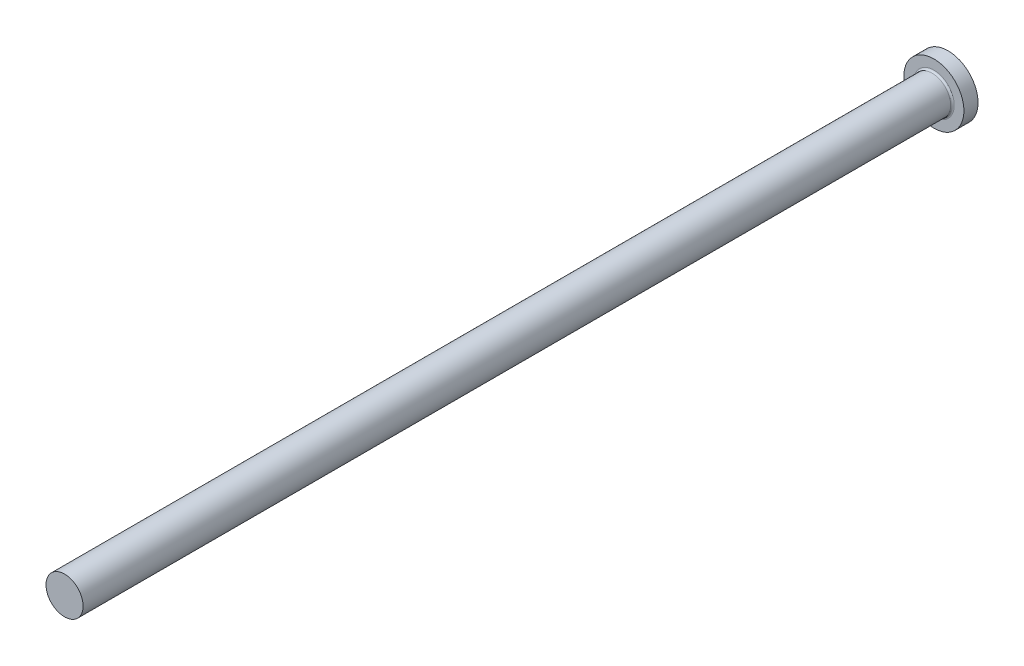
from build123d import *

# Parameters (mm, degrees)
FILLET1_R = 0.5


with BuildPart() as part:
    # FV → Revolve1 (revolve)
    with BuildSketch(Plane(origin=(0, 0, 0), x_dir=(1, 0, 0), z_dir=(0, 1, 0)), mode=Mode.PRIVATE) as revolve1_sk:
        Polygon((0, 0), (8.5, 0), (8.5, -4), (5.25, -4), (5.25, -250), (0, -250), align=None)
    revolve(revolve1_sk.sketch.rotate(Axis((0, 0, -9.033228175), (0, 0, 1)), 180), axis=Axis((0, 0, -9.033228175), (0, 0, 1)))

    # Fillet1
    fillet1_edges = [part.edges().sort_by_distance(p)[0] for p in [
        (5.25, 0, 4),
    ]]
    fillet(fillet1_edges, radius=FILLET1_R)


solid = part.part
